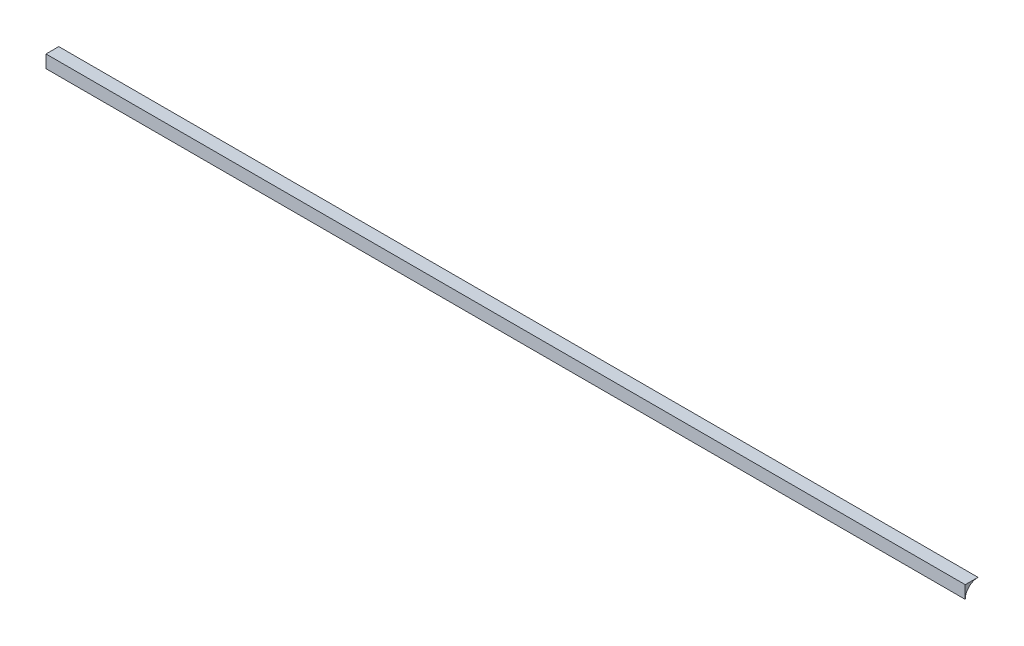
ISO-10303-21;
HEADER;
FILE_DESCRIPTION(('STEP AP214'),'2;1');
FILE_NAME('part.step','',(''),(''),'','','');
FILE_SCHEMA(('AUTOMOTIVE_DESIGN { 1 0 10303 214 1 1 1 1 }'));
ENDSEC;
DATA;
#1=APPLICATION_CONTEXT('core data for automotive mechanical design processes');
#2=APPLICATION_PROTOCOL_DEFINITION('international standard','automotive_design',2000,#1);
#3=PRODUCT_CONTEXT('',#1,'mechanical');
#4=PRODUCT('Part','Part','',(#3));
#5=PRODUCT_RELATED_PRODUCT_CATEGORY('part','',(#4));
#6=PRODUCT_DEFINITION_FORMATION('','',#4);
#7=PRODUCT_DEFINITION_CONTEXT('part definition',#1,'design');
#8=PRODUCT_DEFINITION('design','',#6,#7);
#9=PRODUCT_DEFINITION_SHAPE('','',#8);
#10=(LENGTH_UNIT() NAMED_UNIT(*) SI_UNIT(.MILLI.,.METRE.));
#11=(NAMED_UNIT(*) PLANE_ANGLE_UNIT() SI_UNIT($,.RADIAN.));
#12=(NAMED_UNIT(*) SI_UNIT($,.STERADIAN.) SOLID_ANGLE_UNIT());
#13=UNCERTAINTY_MEASURE_WITH_UNIT(LENGTH_MEASURE(1.E-05),#10,'distance_accuracy_value','');
#14=(GEOMETRIC_REPRESENTATION_CONTEXT(3) GLOBAL_UNCERTAINTY_ASSIGNED_CONTEXT((#13)) GLOBAL_UNIT_ASSIGNED_CONTEXT((#10,
#11,#12)) REPRESENTATION_CONTEXT('',''));
#15=CARTESIAN_POINT('',(0.,0.,0.));
#16=DIRECTION('',(0.,0.,1.));
#17=DIRECTION('',(1.,0.,0.));
#18=AXIS2_PLACEMENT_3D('',#15,#16,#17);
#19=CARTESIAN_POINT('',(304.8,0.,0.));
#20=DIRECTION('',(1.,0.,0.));
#21=DIRECTION('',(0.,0.,-1.));
#22=AXIS2_PLACEMENT_3D('',#19,#20,#21);
#23=PLANE('',#22);
#24=DIRECTION('',(0.,0.,1.));
#25=VECTOR('',#24,1.);
#26=CARTESIAN_POINT('',(304.8,152.4,149.225));
#27=LINE('',#26,#25);
#28=CARTESIAN_POINT('',(304.8,152.4,149.225));
#29=VERTEX_POINT('',#28);
#30=CARTESIAN_POINT('',(304.8,152.4,152.4));
#31=VERTEX_POINT('',#30);
#32=EDGE_CURVE('E48',#29,#31,#27,.T.);
#33=ORIENTED_EDGE('',*,*,#32,.T.);
#34=DIRECTION('',(0.,-1.,0.));
#35=VECTOR('',#34,1.);
#36=CARTESIAN_POINT('',(304.8,152.4,152.4));
#37=LINE('',#36,#35);
#38=CARTESIAN_POINT('',(304.8,149.225,152.4));
#39=VERTEX_POINT('',#38);
#40=EDGE_CURVE('E144',#31,#39,#37,.T.);
#41=ORIENTED_EDGE('',*,*,#40,.T.);
#42=DIRECTION('',(0.,0.995184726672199,-0.0980171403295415));
#43=VECTOR('',#42,1.);
#44=CARTESIAN_POINT('',(304.8,149.225,152.4));
#45=LINE('',#44,#43);
#46=CARTESIAN_POINT('',(304.8,149.844411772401,152.33899326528));
#47=VERTEX_POINT('',#46);
#48=EDGE_CURVE('E190',#39,#47,#45,.T.);
#49=ORIENTED_EDGE('',*,*,#48,.T.);
#50=DIRECTION('',(0.,0.956940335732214,-0.290284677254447));
#51=VECTOR('',#50,1.);
#52=CARTESIAN_POINT('',(304.8,149.844411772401,152.33899326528));
#53=LINE('',#52,#51);
#54=CARTESIAN_POINT('',(304.8,150.440019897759,152.158317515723));
#55=VERTEX_POINT('',#54);
#56=EDGE_CURVE('E192',#47,#55,#53,.T.);
#57=ORIENTED_EDGE('',*,*,#56,.T.);
#58=DIRECTION('',(0.,0.881921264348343,-0.47139673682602));
#59=VECTOR('',#58,1.);
#60=CARTESIAN_POINT('',(304.8,150.440019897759,152.158317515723));
#61=LINE('',#60,#59);
#62=CARTESIAN_POINT('',(304.8,150.988935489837,151.864916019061));
#63=VERTEX_POINT('',#62);
#64=EDGE_CURVE('E193',#55,#63,#61,.T.);
#65=ORIENTED_EDGE('',*,*,#64,.T.);
#66=DIRECTION('',(0.,0.773010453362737,-0.634393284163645));
#67=VECTOR('',#66,1.);
#68=CARTESIAN_POINT('',(304.8,150.988935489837,151.864916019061));
#69=LINE('',#68,#67);
#70=CARTESIAN_POINT('',(304.8,151.470064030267,151.470064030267));
#71=VERTEX_POINT('',#70);
#72=EDGE_CURVE('E200',#63,#71,#69,.T.);
#73=ORIENTED_EDGE('',*,*,#72,.T.);
#74=DIRECTION('',(0.,0.634393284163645,-0.773010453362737));
#75=VECTOR('',#74,1.);
#76=CARTESIAN_POINT('',(304.8,151.470064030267,151.470064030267));
#77=LINE('',#76,#75);
#78=CARTESIAN_POINT('',(304.8,151.864916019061,150.988935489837));
#79=VERTEX_POINT('',#78);
#80=EDGE_CURVE('E201',#71,#79,#77,.T.);
#81=ORIENTED_EDGE('',*,*,#80,.T.);
#82=DIRECTION('',(0.,0.47139673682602,-0.881921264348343));
#83=VECTOR('',#82,1.);
#84=CARTESIAN_POINT('',(304.8,151.864916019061,150.988935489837));
#85=LINE('',#84,#83);
#86=CARTESIAN_POINT('',(304.8,152.158317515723,150.440019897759));
#87=VERTEX_POINT('',#86);
#88=EDGE_CURVE('E210',#79,#87,#85,.T.);
#89=ORIENTED_EDGE('',*,*,#88,.T.);
#90=DIRECTION('',(0.,0.290284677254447,-0.956940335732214));
#91=VECTOR('',#90,1.);
#92=CARTESIAN_POINT('',(304.8,152.158317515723,150.440019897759));
#93=LINE('',#92,#91);
#94=CARTESIAN_POINT('',(304.8,152.33899326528,149.844411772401));
#95=VERTEX_POINT('',#94);
#96=EDGE_CURVE('E53',#87,#95,#93,.T.);
#97=ORIENTED_EDGE('',*,*,#96,.T.);
#98=DIRECTION('',(0.,0.0980171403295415,-0.995184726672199));
#99=VECTOR('',#98,1.);
#100=CARTESIAN_POINT('',(304.8,152.33899326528,149.844411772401));
#101=LINE('',#100,#99);
#102=EDGE_CURVE('E11',#95,#29,#101,.T.);
#103=ORIENTED_EDGE('',*,*,#102,.T.);
#104=EDGE_LOOP('',(#33,#41,#49,#57,#65,#73,#81,#89,#97,#103));
#105=FACE_BOUND('',#104,.T.);
#106=ADVANCED_FACE('F44',(#105),#23,.T.);
#107=CARTESIAN_POINT('',(0.,0.,0.));
#108=DIRECTION('',(1.,0.,0.));
#109=DIRECTION('',(0.,0.,-1.));
#110=AXIS2_PLACEMENT_3D('',#107,#108,#109);
#111=PLANE('',#110);
#112=DIRECTION('',(0.,0.,1.));
#113=VECTOR('',#112,1.);
#114=CARTESIAN_POINT('',(0.,76.2,73.025));
#115=LINE('',#114,#113);
#116=CARTESIAN_POINT('',(0.,76.2,73.025));
#117=VERTEX_POINT('',#116);
#118=CARTESIAN_POINT('',(0.,76.2,76.2));
#119=VERTEX_POINT('',#118);
#120=EDGE_CURVE('E122',#117,#119,#115,.T.);
#121=ORIENTED_EDGE('',*,*,#120,.F.);
#122=DIRECTION('',(0.,0.0980171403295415,-0.995184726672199));
#123=VECTOR('',#122,1.);
#124=CARTESIAN_POINT('',(0.,76.1389932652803,73.6444117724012));
#125=LINE('',#124,#123);
#126=CARTESIAN_POINT('',(0.,76.1389932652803,73.6444117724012));
#127=VERTEX_POINT('',#126);
#128=EDGE_CURVE('E150',#127,#117,#125,.T.);
#129=ORIENTED_EDGE('',*,*,#128,.F.);
#130=DIRECTION('',(0.,0.290284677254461,-0.956940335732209));
#131=VECTOR('',#130,1.);
#132=CARTESIAN_POINT('',(0.,75.9583175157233,74.2400198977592));
#133=LINE('',#132,#131);
#134=CARTESIAN_POINT('',(0.,75.9583175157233,74.2400198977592));
#135=VERTEX_POINT('',#134);
#136=EDGE_CURVE('E152',#135,#127,#133,.T.);
#137=ORIENTED_EDGE('',*,*,#136,.F.);
#138=DIRECTION('',(0.,0.47139673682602,-0.881921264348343));
#139=VECTOR('',#138,1.);
#140=CARTESIAN_POINT('',(0.,75.6649160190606,74.7889354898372));
#141=LINE('',#140,#139);
#142=CARTESIAN_POINT('',(0.,75.6649160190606,74.7889354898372));
#143=VERTEX_POINT('',#142);
#144=EDGE_CURVE('E218',#143,#135,#141,.T.);
#145=ORIENTED_EDGE('',*,*,#144,.F.);
#146=DIRECTION('',(0.,0.634393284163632,-0.773010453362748));
#147=VECTOR('',#146,1.);
#148=CARTESIAN_POINT('',(0.,75.2700640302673,75.2700640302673));
#149=LINE('',#148,#147);
#150=CARTESIAN_POINT('',(0.,75.2700640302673,75.2700640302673));
#151=VERTEX_POINT('',#150);
#152=EDGE_CURVE('E225',#151,#143,#149,.T.);
#153=ORIENTED_EDGE('',*,*,#152,.F.);
#154=DIRECTION('',(0.,0.773010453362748,-0.634393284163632));
#155=VECTOR('',#154,1.);
#156=CARTESIAN_POINT('',(0.,74.7889354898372,75.6649160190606));
#157=LINE('',#156,#155);
#158=CARTESIAN_POINT('',(0.,74.7889354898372,75.6649160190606));
#159=VERTEX_POINT('',#158);
#160=EDGE_CURVE('E229',#159,#151,#157,.T.);
#161=ORIENTED_EDGE('',*,*,#160,.F.);
#162=DIRECTION('',(0.,0.881921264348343,-0.47139673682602));
#163=VECTOR('',#162,1.);
#164=CARTESIAN_POINT('',(0.,74.2400198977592,75.9583175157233));
#165=LINE('',#164,#163);
#166=CARTESIAN_POINT('',(0.,74.2400198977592,75.9583175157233));
#167=VERTEX_POINT('',#166);
#168=EDGE_CURVE('E233',#167,#159,#165,.T.);
#169=ORIENTED_EDGE('',*,*,#168,.F.);
#170=DIRECTION('',(0.,0.956940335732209,-0.290284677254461));
#171=VECTOR('',#170,1.);
#172=CARTESIAN_POINT('',(0.,73.6444117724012,76.1389932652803));
#173=LINE('',#172,#171);
#174=CARTESIAN_POINT('',(0.,73.6444117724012,76.1389932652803));
#175=VERTEX_POINT('',#174);
#176=EDGE_CURVE('E236',#175,#167,#173,.T.);
#177=ORIENTED_EDGE('',*,*,#176,.F.);
#178=DIRECTION('',(0.,0.995184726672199,-0.0980171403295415));
#179=VECTOR('',#178,1.);
#180=CARTESIAN_POINT('',(0.,73.025,76.2));
#181=LINE('',#180,#179);
#182=CARTESIAN_POINT('',(0.,73.025,76.2));
#183=VERTEX_POINT('',#182);
#184=EDGE_CURVE('E130',#183,#175,#181,.T.);
#185=ORIENTED_EDGE('',*,*,#184,.F.);
#186=DIRECTION('',(0.,-1.,0.));
#187=VECTOR('',#186,1.);
#188=CARTESIAN_POINT('',(0.,76.2,76.2));
#189=LINE('',#188,#187);
#190=EDGE_CURVE('E121',#119,#183,#189,.T.);
#191=ORIENTED_EDGE('',*,*,#190,.F.);
#192=EDGE_LOOP('',(#121,#129,#137,#145,#153,#161,#169,#177,#185,#191));
#193=FACE_BOUND('',#192,.T.);
#194=ADVANCED_FACE('F123',(#193),#111,.F.);
#195=CARTESIAN_POINT('',(-17.929411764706,71.7176470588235,0.));
#196=DIRECTION('',(0.242535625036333,-0.970142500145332,0.));
#197=DIRECTION('',(0.970142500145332,0.242535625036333,0.));
#198=AXIS2_PLACEMENT_3D('',#195,#196,#197);
#199=PLANE('',#198);
#200=DIRECTION('',(0.942809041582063,0.235702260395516,0.235702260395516));
#201=VECTOR('',#200,1.);
#202=CARTESIAN_POINT('',(0.,76.2,76.2));
#203=LINE('',#202,#201);
#204=EDGE_CURVE('E140',#119,#31,#203,.T.);
#205=ORIENTED_EDGE('',*,*,#204,.T.);
#206=ORIENTED_EDGE('',*,*,#32,.F.);
#207=DIRECTION('',(0.942809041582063,0.235702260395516,0.235702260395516));
#208=VECTOR('',#207,1.);
#209=CARTESIAN_POINT('',(0.,76.2,73.025));
#210=LINE('',#209,#208);
#211=EDGE_CURVE('E138',#117,#29,#210,.T.);
#212=ORIENTED_EDGE('',*,*,#211,.F.);
#213=ORIENTED_EDGE('',*,*,#120,.T.);
#214=EDGE_LOOP('',(#205,#206,#212,#213));
#215=FACE_BOUND('',#214,.T.);
#216=ADVANCED_FACE('F137',(#215),#199,.F.);
#217=CARTESIAN_POINT('',(-21.1050181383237,76.8509178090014,7.56915474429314));
#218=DIRECTION('',(-0.263632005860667,0.959978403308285,0.0945496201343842));
#219=DIRECTION('',(-0.964298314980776,-0.264818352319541,0.));
#220=AXIS2_PLACEMENT_3D('',#217,#218,#219);
#221=PLANE('',#220);
#222=ORIENTED_EDGE('',*,*,#211,.T.);
#223=ORIENTED_EDGE('',*,*,#102,.F.);
#224=DIRECTION('',(0.942809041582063,0.235702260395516,0.235702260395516));
#225=VECTOR('',#224,1.);
#226=CARTESIAN_POINT('',(0.,76.1389932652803,73.6444117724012));
#227=LINE('',#226,#225);
#228=EDGE_CURVE('E66',#127,#95,#227,.T.);
#229=ORIENTED_EDGE('',*,*,#228,.F.);
#230=ORIENTED_EDGE('',*,*,#128,.T.);
#231=EDGE_LOOP('',(#222,#223,#229,#230));
#232=FACE_BOUND('',#231,.T.);
#233=ADVANCED_FACE('F310',(#232),#221,.F.);
#234=CARTESIAN_POINT('',(-17.929411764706,0.,71.7176470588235));
#235=DIRECTION('',(0.242535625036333,0.,-0.970142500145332));
#236=DIRECTION('',(-0.970142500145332,0.,-0.242535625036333));
#237=AXIS2_PLACEMENT_3D('',#234,#235,#236);
#238=PLANE('',#237);
#239=DIRECTION('',(0.942809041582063,0.235702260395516,0.235702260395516));
#240=VECTOR('',#239,1.);
#241=CARTESIAN_POINT('',(0.,73.025,76.2));
#242=LINE('',#241,#240);
#243=EDGE_CURVE('E155',#183,#39,#242,.T.);
#244=ORIENTED_EDGE('',*,*,#243,.T.);
#245=ORIENTED_EDGE('',*,*,#40,.F.);
#246=ORIENTED_EDGE('',*,*,#204,.F.);
#247=ORIENTED_EDGE('',*,*,#190,.T.);
#248=EDGE_LOOP('',(#244,#245,#246,#247));
#249=FACE_BOUND('',#248,.T.);
#250=ADVANCED_FACE('F145',(#249),#238,.F.);
#251=CARTESIAN_POINT('',(-21.1050181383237,7.56915474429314,76.8509178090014));
#252=DIRECTION('',(-0.263632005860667,0.0945496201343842,0.959978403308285));
#253=DIRECTION('',(0.964298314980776,0.,0.264818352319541));
#254=AXIS2_PLACEMENT_3D('',#251,#252,#253);
#255=PLANE('',#254);
#256=DIRECTION('',(0.942809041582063,0.235702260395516,0.235702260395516));
#257=VECTOR('',#256,1.);
#258=CARTESIAN_POINT('',(0.,73.6444117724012,76.1389932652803));
#259=LINE('',#258,#257);
#260=EDGE_CURVE('E157',#175,#47,#259,.T.);
#261=ORIENTED_EDGE('',*,*,#260,.T.);
#262=ORIENTED_EDGE('',*,*,#48,.F.);
#263=ORIENTED_EDGE('',*,*,#243,.F.);
#264=ORIENTED_EDGE('',*,*,#184,.T.);
#265=EDGE_LOOP('',(#261,#262,#263,#264));
#266=FACE_BOUND('',#265,.T.);
#267=ADVANCED_FACE('F247',(#266),#255,.F.);
#268=CARTESIAN_POINT('',(-26.7804203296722,24.9319748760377,82.1897064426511));
#269=DIRECTION('',(-0.297671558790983,0.277125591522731,0.9135606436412));
#270=DIRECTION('',(0.950799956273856,0.,0.30980549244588));
#271=AXIS2_PLACEMENT_3D('',#268,#269,#270);
#272=PLANE('',#271);
#273=DIRECTION('',(0.942809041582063,0.235702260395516,0.235702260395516));
#274=VECTOR('',#273,1.);
#275=CARTESIAN_POINT('',(0.,74.2400198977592,75.9583175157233));
#276=LINE('',#275,#274);
#277=EDGE_CURVE('E162',#167,#55,#276,.T.);
#278=ORIENTED_EDGE('',*,*,#277,.T.);
#279=ORIENTED_EDGE('',*,*,#56,.F.);
#280=ORIENTED_EDGE('',*,*,#260,.F.);
#281=ORIENTED_EDGE('',*,*,#176,.T.);
#282=EDGE_LOOP('',(#278,#279,#280,#281));
#283=FACE_BOUND('',#282,.T.);
#284=ADVANCED_FACE('F246',(#283),#272,.F.);
#285=CARTESIAN_POINT('',(-30.9608048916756,43.1378948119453,80.705324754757));
#286=DIRECTION('',(-0.320483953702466,0.446532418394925,0.835403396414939));
#287=DIRECTION('',(0.,-0.881921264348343,0.47139673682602));
#288=AXIS2_PLACEMENT_3D('',#285,#286,#287);
#289=PLANE('',#288);
#290=DIRECTION('',(0.942809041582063,0.235702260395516,0.235702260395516));
#291=VECTOR('',#290,1.);
#292=CARTESIAN_POINT('',(0.,74.7889354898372,75.6649160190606));
#293=LINE('',#292,#291);
#294=EDGE_CURVE('E170',#159,#63,#293,.T.);
#295=ORIENTED_EDGE('',*,*,#294,.T.);
#296=ORIENTED_EDGE('',*,*,#64,.F.);
#297=ORIENTED_EDGE('',*,*,#277,.F.);
#298=ORIENTED_EDGE('',*,*,#168,.T.);
#299=EDGE_LOOP('',(#295,#296,#297,#298));
#300=FACE_BOUND('',#299,.T.);
#301=ADVANCED_FACE('F346',(#300),#289,.F.);
#302=CARTESIAN_POINT('',(-33.1673689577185,59.8013364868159,72.8681393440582));
#303=DIRECTION('',(-0.331905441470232,0.598431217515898,0.729190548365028));
#304=DIRECTION('',(0.,-0.773010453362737,0.634393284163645));
#305=AXIS2_PLACEMENT_3D('',#302,#303,#304);
#306=PLANE('',#305);
#307=DIRECTION('',(0.942809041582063,0.235702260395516,0.235702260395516));
#308=VECTOR('',#307,1.);
#309=CARTESIAN_POINT('',(0.,75.2700640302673,75.2700640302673));
#310=LINE('',#309,#308);
#311=EDGE_CURVE('E172',#151,#71,#310,.T.);
#312=ORIENTED_EDGE('',*,*,#311,.T.);
#313=ORIENTED_EDGE('',*,*,#72,.F.);
#314=ORIENTED_EDGE('',*,*,#294,.F.);
#315=ORIENTED_EDGE('',*,*,#160,.T.);
#316=EDGE_LOOP('',(#312,#313,#314,#315));
#317=FACE_BOUND('',#316,.T.);
#318=ADVANCED_FACE('F353',(#317),#306,.F.);
#319=CARTESIAN_POINT('',(-33.1673689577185,72.8681393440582,59.8013364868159));
#320=DIRECTION('',(-0.331905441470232,0.729190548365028,0.598431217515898));
#321=DIRECTION('',(0.,-0.634393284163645,0.773010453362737));
#322=AXIS2_PLACEMENT_3D('',#319,#320,#321);
#323=PLANE('',#322);
#324=DIRECTION('',(0.942809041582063,0.235702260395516,0.235702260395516));
#325=VECTOR('',#324,1.);
#326=CARTESIAN_POINT('',(0.,75.6649160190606,74.7889354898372));
#327=LINE('',#326,#325);
#328=EDGE_CURVE('E173',#143,#79,#327,.T.);
#329=ORIENTED_EDGE('',*,*,#328,.T.);
#330=ORIENTED_EDGE('',*,*,#80,.F.);
#331=ORIENTED_EDGE('',*,*,#311,.F.);
#332=ORIENTED_EDGE('',*,*,#152,.T.);
#333=EDGE_LOOP('',(#329,#330,#331,#332));
#334=FACE_BOUND('',#333,.T.);
#335=ADVANCED_FACE('F361',(#334),#323,.F.);
#336=CARTESIAN_POINT('',(-30.9608048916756,80.705324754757,43.1378948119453));
#337=DIRECTION('',(-0.320483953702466,0.835403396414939,0.446532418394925));
#338=DIRECTION('',(0.,-0.47139673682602,0.881921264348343));
#339=AXIS2_PLACEMENT_3D('',#336,#337,#338);
#340=PLANE('',#339);
#341=DIRECTION('',(0.942809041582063,0.235702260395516,0.235702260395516));
#342=VECTOR('',#341,1.);
#343=CARTESIAN_POINT('',(0.,75.9583175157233,74.2400198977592));
#344=LINE('',#343,#342);
#345=EDGE_CURVE('E178',#135,#87,#344,.T.);
#346=ORIENTED_EDGE('',*,*,#345,.T.);
#347=ORIENTED_EDGE('',*,*,#88,.F.);
#348=ORIENTED_EDGE('',*,*,#328,.F.);
#349=ORIENTED_EDGE('',*,*,#144,.T.);
#350=EDGE_LOOP('',(#346,#347,#348,#349));
#351=FACE_BOUND('',#350,.T.);
#352=ADVANCED_FACE('F220',(#351),#340,.F.);
#353=CARTESIAN_POINT('',(-26.7804203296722,82.1897064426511,24.9319748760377));
#354=DIRECTION('',(-0.297671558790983,0.9135606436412,0.277125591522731));
#355=DIRECTION('',(-0.950799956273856,-0.30980549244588,0.));
#356=AXIS2_PLACEMENT_3D('',#353,#354,#355);
#357=PLANE('',#356);
#358=ORIENTED_EDGE('',*,*,#228,.T.);
#359=ORIENTED_EDGE('',*,*,#96,.F.);
#360=ORIENTED_EDGE('',*,*,#345,.F.);
#361=ORIENTED_EDGE('',*,*,#136,.T.);
#362=EDGE_LOOP('',(#358,#359,#360,#361));
#363=FACE_BOUND('',#362,.T.);
#364=ADVANCED_FACE('F212',(#363),#357,.F.);
#365=CLOSED_SHELL('',(#106,#194,#216,#233,#250,#267,#284,#301,#318,#335,#352,#364));
#366=MANIFOLD_SOLID_BREP('B2',#365);
#367=ADVANCED_BREP_SHAPE_REPRESENTATION('',(#18,#366),#14);
#368=SHAPE_DEFINITION_REPRESENTATION(#9,#367);
ENDSEC;
END-ISO-10303-21;
